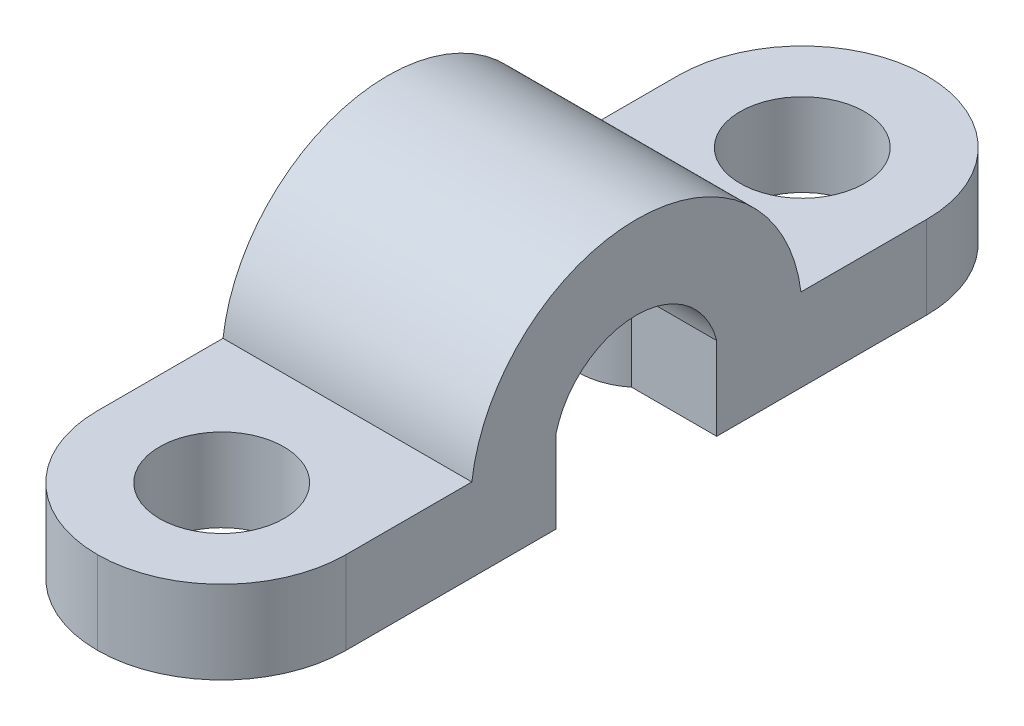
ISO-10303-21;
HEADER;
FILE_DESCRIPTION(('STEP AP214'),'2;1');
FILE_NAME('part.step','',(''),(''),'','','');
FILE_SCHEMA(('AUTOMOTIVE_DESIGN { 1 0 10303 214 1 1 1 1 }'));
ENDSEC;
DATA;
#1=APPLICATION_CONTEXT('core data for automotive mechanical design processes');
#2=APPLICATION_PROTOCOL_DEFINITION('international standard','automotive_design',2000,#1);
#3=PRODUCT_CONTEXT('',#1,'mechanical');
#4=PRODUCT('Part','Part','',(#3));
#5=PRODUCT_RELATED_PRODUCT_CATEGORY('part','',(#4));
#6=PRODUCT_DEFINITION_FORMATION('','',#4);
#7=PRODUCT_DEFINITION_CONTEXT('part definition',#1,'design');
#8=PRODUCT_DEFINITION('design','',#6,#7);
#9=PRODUCT_DEFINITION_SHAPE('','',#8);
#10=(LENGTH_UNIT() NAMED_UNIT(*) SI_UNIT(.MILLI.,.METRE.));
#11=(NAMED_UNIT(*) PLANE_ANGLE_UNIT() SI_UNIT($,.RADIAN.));
#12=(NAMED_UNIT(*) SI_UNIT($,.STERADIAN.) SOLID_ANGLE_UNIT());
#13=UNCERTAINTY_MEASURE_WITH_UNIT(LENGTH_MEASURE(1.E-05),#10,'distance_accuracy_value','');
#14=(GEOMETRIC_REPRESENTATION_CONTEXT(3) GLOBAL_UNCERTAINTY_ASSIGNED_CONTEXT((#13)) GLOBAL_UNIT_ASSIGNED_CONTEXT((#10,
#11,#12)) REPRESENTATION_CONTEXT('',''));
#15=CARTESIAN_POINT('',(0.,0.,0.));
#16=DIRECTION('',(0.,0.,1.));
#17=DIRECTION('',(1.,0.,0.));
#18=AXIS2_PLACEMENT_3D('',#15,#16,#17);
#19=CARTESIAN_POINT('',(3.,0.5,1.93649167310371));
#20=DIRECTION('',(0.,0.,1.));
#21=DIRECTION('',(1.,0.,0.));
#22=AXIS2_PLACEMENT_3D('',#19,#20,#21);
#23=PLANE('',#22);
#24=DIRECTION('',(-1.,0.,0.));
#25=VECTOR('',#24,1.);
#26=CARTESIAN_POINT('',(3.,-1.5,1.93649167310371));
#27=LINE('',#26,#25);
#28=CARTESIAN_POINT('',(3.,-1.5,1.93649167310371));
#29=VERTEX_POINT('',#28);
#30=CARTESIAN_POINT('',(0.946703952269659,-1.5,1.93649167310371));
#31=VERTEX_POINT('',#30);
#32=EDGE_CURVE('E178',#29,#31,#27,.T.);
#33=ORIENTED_EDGE('',*,*,#32,.T.);
#34=DIRECTION('',(0.,1.,0.));
#35=VECTOR('',#34,1.);
#36=CARTESIAN_POINT('',(0.946703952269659,-1.5,1.93649167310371));
#37=LINE('',#36,#35);
#38=CARTESIAN_POINT('',(0.946703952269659,0.,1.93649167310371));
#39=VERTEX_POINT('',#38);
#40=EDGE_CURVE('E158',#31,#39,#37,.T.);
#41=ORIENTED_EDGE('',*,*,#40,.T.);
#42=CARTESIAN_POINT('',(-0.960314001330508,0.208644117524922,1.93649167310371));
#43=CARTESIAN_POINT('',(-0.953571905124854,0.156180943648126,1.93649167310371));
#44=CARTESIAN_POINT('',(-0.949204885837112,0.103401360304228,1.93649167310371));
#45=CARTESIAN_POINT('',(-0.945821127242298,-0.00237025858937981,1.93649167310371));
#46=CARTESIAN_POINT('',(-0.9468076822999,-0.0553624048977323,1.93649167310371));
#47=CARTESIAN_POINT('',(-0.954035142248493,-0.161547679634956,1.93649167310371));
#48=CARTESIAN_POINT('',(-0.96033282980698,-0.214736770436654,1.93649167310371));
#49=CARTESIAN_POINT('',(-0.977413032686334,-0.320354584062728,1.93649167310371));
#50=CARTESIAN_POINT('',(-0.988195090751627,-0.372783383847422,1.93649167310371));
#51=CARTESIAN_POINT('',(-1.01940690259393,-0.503255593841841,1.93649167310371));
#52=CARTESIAN_POINT('',(-1.04195497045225,-0.58077586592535,1.93649167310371));
#53=CARTESIAN_POINT('',(-1.09088787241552,-0.73462084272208,1.93649167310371));
#54=CARTESIAN_POINT('',(-1.11727737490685,-0.810943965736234,1.93649167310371));
#55=CARTESIAN_POINT('',(-1.17115477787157,-0.963526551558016,1.93649167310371));
#56=CARTESIAN_POINT('',(-1.19864651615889,-1.03978463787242,1.93649167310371));
#57=CARTESIAN_POINT('',(-1.25251907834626,-1.19265249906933,1.93649167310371));
#58=CARTESIAN_POINT('',(-1.27890052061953,-1.26926205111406,1.93649167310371));
#59=CARTESIAN_POINT('',(-1.32870023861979,-1.42266986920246,1.93649167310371));
#60=CARTESIAN_POINT('',(-1.35214380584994,-1.49945974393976,1.93649167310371));
#61=CARTESIAN_POINT('',(-1.39500428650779,-1.65414920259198,1.93649167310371));
#62=CARTESIAN_POINT('',(-1.41442251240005,-1.73204841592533,1.93649167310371));
#63=CARTESIAN_POINT('',(-1.4479865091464,-1.88871952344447,1.93649167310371));
#64=CARTESIAN_POINT('',(-1.46215040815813,-1.96748743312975,1.93649167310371));
#65=CARTESIAN_POINT('',(-1.48420595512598,-2.12587638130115,1.93649167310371));
#66=CARTESIAN_POINT('',(-1.49209995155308,-2.20549708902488,1.93649167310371));
#67=CARTESIAN_POINT('',(-1.5026402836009,-2.40338689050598,1.93649167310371));
#68=CARTESIAN_POINT('',(-1.50097493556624,-2.52193888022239,1.93649167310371));
#69=CARTESIAN_POINT('',(-1.4787506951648,-2.75809656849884,1.93649167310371));
#70=CARTESIAN_POINT('',(-1.45808650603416,-2.87569330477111,1.93649167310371));
#71=CARTESIAN_POINT('',(-1.40116166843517,-3.08485429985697,1.93649167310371));
#72=CARTESIAN_POINT('',(-1.36831263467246,-3.17733962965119,1.93649167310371));
#73=CARTESIAN_POINT('',(-1.28783893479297,-3.35547566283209,1.93649167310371));
#74=CARTESIAN_POINT('',(-1.24025003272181,-3.44114228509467,1.93649167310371));
#75=CARTESIAN_POINT('',(-1.13009046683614,-3.60326123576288,1.93649167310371));
#76=CARTESIAN_POINT('',(-1.06741122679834,-3.67964045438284,1.93649167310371));
#77=CARTESIAN_POINT('',(-0.928459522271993,-3.81898975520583,1.93649167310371));
#78=CARTESIAN_POINT('',(-0.852185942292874,-3.88195873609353,1.93649167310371));
#79=CARTESIAN_POINT('',(-0.698416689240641,-3.98453471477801,1.93649167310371));
#80=CARTESIAN_POINT('',(-0.622190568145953,-4.02604862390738,1.93649167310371));
#81=CARTESIAN_POINT('',(-0.463413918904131,-4.09432034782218,1.93649167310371));
#82=CARTESIAN_POINT('',(-0.380868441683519,-4.12108981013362,1.93649167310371));
#83=CARTESIAN_POINT('',(-0.219336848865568,-4.15706217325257,1.93649167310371));
#84=CARTESIAN_POINT('',(-0.140635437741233,-4.16755336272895,1.93649167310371));
#85=CARTESIAN_POINT('',(0.017389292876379,-4.17471283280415,1.93649167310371));
#86=CARTESIAN_POINT('',(0.0967124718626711,-4.17138415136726,1.93649167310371));
#87=CARTESIAN_POINT('',(0.251149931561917,-4.1513605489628,1.93649167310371));
#88=CARTESIAN_POINT('',(0.326318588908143,-4.13508063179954,1.93649167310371));
#89=CARTESIAN_POINT('',(0.472908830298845,-4.09029649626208,1.93649167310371));
#90=CARTESIAN_POINT('',(0.544330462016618,-4.0617924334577,1.93649167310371));
#91=CARTESIAN_POINT('',(0.682549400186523,-3.99312631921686,1.93649167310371));
#92=CARTESIAN_POINT('',(0.749269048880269,-3.95280841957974,1.93649167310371));
#93=CARTESIAN_POINT('',(0.875443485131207,-3.86209269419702,1.93649167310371));
#94=CARTESIAN_POINT('',(0.934896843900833,-3.81169289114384,1.93649167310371));
#95=CARTESIAN_POINT('',(1.04847329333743,-3.69940677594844,1.93649167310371));
#96=CARTESIAN_POINT('',(1.10211946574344,-3.63703921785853,1.93649167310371));
#97=CARTESIAN_POINT('',(1.19926725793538,-3.50489034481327,1.93649167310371));
#98=CARTESIAN_POINT('',(1.24276721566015,-3.43510781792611,1.93649167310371));
#99=CARTESIAN_POINT('',(1.32311050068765,-3.28289416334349,1.93649167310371));
#100=CARTESIAN_POINT('',(1.35887331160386,-3.19989439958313,1.93649167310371));
#101=CARTESIAN_POINT('',(1.41802081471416,-3.02957765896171,1.93649167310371));
#102=CARTESIAN_POINT('',(1.44139182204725,-2.94225602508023,1.93649167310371));
#103=CARTESIAN_POINT('',(1.48424907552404,-2.72553497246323,1.93649167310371));
#104=CARTESIAN_POINT('',(1.49727720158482,-2.59485003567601,1.93649167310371));
#105=CARTESIAN_POINT('',(1.50195117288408,-2.33346574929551,1.93649167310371));
#106=CARTESIAN_POINT('',(1.49361221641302,-2.20276647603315,1.93649167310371));
#107=CARTESIAN_POINT('',(1.46376374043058,-1.97340486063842,1.93649167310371));
#108=CARTESIAN_POINT('',(1.44570193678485,-1.87425082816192,1.93649167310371));
#109=CARTESIAN_POINT('',(1.40161706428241,-1.67770892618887,1.93649167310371));
#110=CARTESIAN_POINT('',(1.37558904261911,-1.5803221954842,1.93649167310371));
#111=CARTESIAN_POINT('',(1.31772239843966,-1.38629666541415,1.93649167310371));
#112=CARTESIAN_POINT('',(1.28582870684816,-1.28967486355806,1.93649167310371));
#113=CARTESIAN_POINT('',(1.21935099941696,-1.09740675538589,1.93649167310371));
#114=CARTESIAN_POINT('',(1.18476731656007,-1.0017603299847,1.93649167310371));
#115=CARTESIAN_POINT('',(1.12823332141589,-0.842131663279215,1.93649167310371));
#116=CARTESIAN_POINT('',(1.10593207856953,-0.778276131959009,1.93649167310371));
#117=CARTESIAN_POINT('',(1.06347537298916,-0.64980411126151,1.93649167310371));
#118=CARTESIAN_POINT('',(1.04332080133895,-0.585187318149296,1.93649167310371));
#119=CARTESIAN_POINT('',(1.00751894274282,-0.455890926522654,1.93649167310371));
#120=CARTESIAN_POINT('',(0.99179865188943,-0.391232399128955,1.93649167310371));
#121=CARTESIAN_POINT('',(0.966674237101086,-0.260715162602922,1.93649167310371));
#122=CARTESIAN_POINT('',(0.957262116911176,-0.194858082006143,1.93649167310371));
#123=CARTESIAN_POINT('',(0.94643932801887,-0.060568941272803,1.93649167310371));
#124=CARTESIAN_POINT('',(0.945261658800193,0.00788337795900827,1.93649167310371));
#125=CARTESIAN_POINT('',(0.951817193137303,0.144375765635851,1.93649167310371));
#126=CARTESIAN_POINT('',(0.959556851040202,0.212415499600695,1.93649167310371));
#127=CARTESIAN_POINT('',(0.982417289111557,0.348266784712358,1.93649167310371));
#128=CARTESIAN_POINT('',(0.99765265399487,0.41605778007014,1.93649167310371));
#129=CARTESIAN_POINT('',(1.03300033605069,0.55033902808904,1.93649167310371));
#130=CARTESIAN_POINT('',(1.05311582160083,0.616828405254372,1.93649167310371));
#131=CARTESIAN_POINT('',(1.1038143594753,0.773379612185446,1.93649167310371));
#132=CARTESIAN_POINT('',(1.13551735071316,0.863065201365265,1.93649167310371));
#133=CARTESIAN_POINT('',(1.19934456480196,1.04225104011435,1.93649167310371));
#134=CARTESIAN_POINT('',(1.23146871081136,1.13175132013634,1.93649167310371));
#135=CARTESIAN_POINT('',(1.29287633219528,1.31101859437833,1.93649167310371));
#136=CARTESIAN_POINT('',(1.32217905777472,1.40077872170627,1.93649167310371));
#137=CARTESIAN_POINT('',(1.3758650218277,1.58174910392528,1.93649167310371));
#138=CARTESIAN_POINT('',(1.40024976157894,1.67295890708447,1.93649167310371));
#139=CARTESIAN_POINT('',(1.45321438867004,1.90587756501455,1.93649167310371));
#140=CARTESIAN_POINT('',(1.47716279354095,2.04871891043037,1.93649167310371));
#141=CARTESIAN_POINT('',(1.5024651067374,2.33693081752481,1.93649167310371));
#142=CARTESIAN_POINT('',(1.50378987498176,2.48230439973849,1.93649167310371));
#143=CARTESIAN_POINT('',(1.48171782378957,2.73301171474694,1.93649167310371));
#144=CARTESIAN_POINT('',(1.46468469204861,2.83889047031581,1.93649167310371));
#145=CARTESIAN_POINT('',(1.41372726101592,3.04651722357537,1.93649167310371));
#146=CARTESIAN_POINT('',(1.37982031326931,3.14826934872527,1.93649167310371));
#147=CARTESIAN_POINT('',(1.29388936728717,3.34502888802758,1.93649167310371));
#148=CARTESIAN_POINT('',(1.241704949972,3.43996730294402,1.93649167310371));
#149=CARTESIAN_POINT('',(1.11955276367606,3.6177261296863,1.93649167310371));
#150=CARTESIAN_POINT('',(1.0495951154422,3.70055339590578,1.93649167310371));
#151=CARTESIAN_POINT('',(0.904873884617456,3.83887041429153,1.93649167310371));
#152=CARTESIAN_POINT('',(0.832224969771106,3.89657523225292,1.93649167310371));
#153=CARTESIAN_POINT('',(0.677254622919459,3.99705917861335,1.93649167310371));
#154=CARTESIAN_POINT('',(0.594942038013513,4.03985181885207,1.93649167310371));
#155=CARTESIAN_POINT('',(0.43338588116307,4.1044225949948,1.93649167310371));
#156=CARTESIAN_POINT('',(0.354877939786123,4.12805145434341,1.93649167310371));
#157=CARTESIAN_POINT('',(0.19491498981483,4.16095913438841,1.93649167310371));
#158=CARTESIAN_POINT('',(0.113461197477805,4.17024380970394,1.93649167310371));
#159=CARTESIAN_POINT('',(-0.04538954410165,4.17396650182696,1.93649167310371));
#160=CARTESIAN_POINT('',(-0.12276959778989,4.16917459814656,1.93649167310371));
#161=CARTESIAN_POINT('',(-0.275598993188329,4.14658567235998,1.93649167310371));
#162=CARTESIAN_POINT('',(-0.351048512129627,4.1287898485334,1.93649167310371));
#163=CARTESIAN_POINT('',(-0.497527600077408,4.0810049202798,1.93649167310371));
#164=CARTESIAN_POINT('',(-0.568578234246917,4.05108011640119,1.93649167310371));
#165=CARTESIAN_POINT('',(-0.704886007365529,3.98013498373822,1.93649167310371));
#166=CARTESIAN_POINT('',(-0.770142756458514,3.93911390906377,1.93649167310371));
#167=CARTESIAN_POINT('',(-0.895691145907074,3.84567608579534,1.93649167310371));
#168=CARTESIAN_POINT('',(-0.955710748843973,3.79289471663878,1.93649167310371));
#169=CARTESIAN_POINT('',(-1.06681914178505,3.67866352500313,1.93649167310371));
#170=CARTESIAN_POINT('',(-1.11790494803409,3.61721081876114,1.93649167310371));
#171=CARTESIAN_POINT('',(-1.21411270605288,3.48234408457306,1.93649167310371));
#172=CARTESIAN_POINT('',(-1.25844571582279,3.40836880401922,1.93649167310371));
#173=CARTESIAN_POINT('',(-1.33562890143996,3.25469785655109,1.93649167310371));
#174=CARTESIAN_POINT('',(-1.36847671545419,3.17500101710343,1.93649167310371));
#175=CARTESIAN_POINT('',(-1.42638034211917,3.0015052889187,1.93649167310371));
#176=CARTESIAN_POINT('',(-1.44991437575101,2.9072017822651,1.93649167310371));
#177=CARTESIAN_POINT('',(-1.48359170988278,2.71625821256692,1.93649167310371));
#178=CARTESIAN_POINT('',(-1.49372805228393,2.61961696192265,1.93649167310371));
#179=CARTESIAN_POINT('',(-1.5011945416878,2.44412831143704,1.93649167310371));
#180=CARTESIAN_POINT('',(-1.50057442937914,2.3653522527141,1.93649167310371));
#181=CARTESIAN_POINT('',(-1.49227964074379,2.20813197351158,1.93649167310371));
#182=CARTESIAN_POINT('',(-1.48459975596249,2.1296880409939,1.93649167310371));
#183=CARTESIAN_POINT('',(-1.46308483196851,1.97327078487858,1.93649167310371));
#184=CARTESIAN_POINT('',(-1.44921876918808,1.89530186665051,1.93649167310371));
#185=CARTESIAN_POINT('',(-1.41640219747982,1.74053414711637,1.93649167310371));
#186=CARTESIAN_POINT('',(-1.3974560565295,1.66373440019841,1.93649167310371));
#187=CARTESIAN_POINT('',(-1.3444157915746,1.47056528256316,1.93649167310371));
#188=CARTESIAN_POINT('',(-1.30763322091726,1.35494869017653,1.93649167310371));
#189=CARTESIAN_POINT('',(-1.24899474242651,1.18257975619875,1.93649167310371));
#190=CARTESIAN_POINT('',(-1.2288371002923,1.12521108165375,1.93649167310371));
#191=CARTESIAN_POINT('',(-1.18814156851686,1.01060763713,1.93649167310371));
#192=CARTESIAN_POINT('',(-1.16760369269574,0.953372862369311,1.93649167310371));
#193=CARTESIAN_POINT('',(-1.12745135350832,0.839838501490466,1.93649167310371));
#194=CARTESIAN_POINT('',(-1.10782668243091,0.783542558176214,1.93649167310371));
#195=CARTESIAN_POINT('',(-1.07015615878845,0.670391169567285,1.93649167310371));
#196=CARTESIAN_POINT('',(-1.05211083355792,0.613535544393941,1.93649167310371));
#197=CARTESIAN_POINT('',(-1.0190394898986,0.499223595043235,1.93649167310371));
#198=CARTESIAN_POINT('',(-1.00399937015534,0.441771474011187,1.93649167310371));
#199=CARTESIAN_POINT('',(-0.978418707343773,0.325892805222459,1.93649167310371));
#200=CARTESIAN_POINT('',(-0.967873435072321,0.267467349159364,1.93649167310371));
#201=CARTESIAN_POINT('',(-0.960314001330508,0.208644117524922,1.93649167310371));
#202=B_SPLINE_CURVE_WITH_KNOTS('',3,(#42,#43,#44,#45,#46,#47,#48,#49,#50,#51,#52,#53,#54,#55,
#56,#57,#58,#59,#60,#61,#62,#63,#64,#65,#66,#67,#68,#69,#70,#71,#72,#73,#74,#75,#76,#77,#78,#79,
#80,#81,#82,#83,#84,#85,#86,#87,#88,#89,#90,#91,#92,#93,#94,#95,#96,#97,#98,#99,#100,#101,#102,
#103,#104,#105,#106,#107,#108,#109,#110,#111,#112,#113,#114,#115,#116,#117,#118,#119,#120,#121,
#122,#123,#124,#125,#126,#127,#128,#129,#130,#131,#132,#133,#134,#135,#136,#137,#138,#139,#140,
#141,#142,#143,#144,#145,#146,#147,#148,#149,#150,#151,#152,#153,#154,#155,#156,#157,#158,#159,
#160,#161,#162,#163,#164,#165,#166,#167,#168,#169,#170,#171,#172,#173,#174,#175,#176,#177,#178,
#179,#180,#181,#182,#183,#184,#185,#186,#187,#188,#189,#190,#191,#192,#193,#194,#195,#196,#197,
#198,#199,#200,#201),.UNSPECIFIED.,.T.,.F.,(4,2,2,2,2,2,2,2,2,2,2,2,2,2,2,2,2,2,2,2,2,2,2,2,2,2,
2,2,2,2,2,2,2,2,2,2,2,2,2,2,2,2,2,2,2,2,2,2,2,2,2,2,2,2,2,2,2,2,2,2,2,2,2,2,2,2,2,2,2,2,2,2,2,2,
2,2,2,2,2,4),(0.,0.158629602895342,0.317356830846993,0.477802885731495,0.63823258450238,
0.880191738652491,1.12244743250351,1.36563584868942,1.60868697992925,1.84947618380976,
2.09018675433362,2.33005894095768,2.56984123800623,2.92423291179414,3.28060063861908,
3.57383446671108,3.86636230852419,4.16106135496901,4.45578459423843,4.71477215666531,
4.97355483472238,5.21056841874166,5.44752990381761,5.67719007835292,5.90684733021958,
6.13968222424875,6.37256282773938,6.61832839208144,6.86413418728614,7.13419688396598,
7.40455720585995,7.79633370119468,8.1878316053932,8.48980661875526,8.79196976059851,
9.0971297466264,9.40225201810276,9.60515558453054,9.80814305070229,10.0075622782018,
10.2067282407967,10.4115077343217,10.6164355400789,10.8245981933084,11.0328963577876,
11.3182294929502,11.6035112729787,11.8866833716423,12.1697688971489,12.6029582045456,
13.0367054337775,13.357215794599,13.67739724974,14.0004623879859,14.3233439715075,
14.6000944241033,14.876593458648,15.121295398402,15.365897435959,15.5973716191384,
15.8288244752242,16.0590660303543,16.2893230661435,16.5280758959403,16.7669083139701,
17.0245909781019,17.2823266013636,17.5728328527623,17.8634899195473,18.0994894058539,
18.3356631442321,18.5730348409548,18.8102030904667,19.1739244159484,19.3563531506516,
19.5387752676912,19.7176239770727,19.8965321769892,20.0745800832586,20.2524401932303),.UNSPECIFIED.);
#203=CARTESIAN_POINT('',(1.01980390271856,0.5,1.93649167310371));
#204=VERTEX_POINT('',#203);
#205=EDGE_CURVE('E379',#39,#204,#202,.T.);
#206=ORIENTED_EDGE('',*,*,#205,.T.);
#207=DIRECTION('',(-1.,0.,0.));
#208=VECTOR('',#207,1.);
#209=CARTESIAN_POINT('',(3.,0.5,1.93649167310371));
#210=LINE('',#209,#208);
#211=CARTESIAN_POINT('',(3.,0.5,1.93649167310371));
#212=VERTEX_POINT('',#211);
#213=EDGE_CURVE('E200',#212,#204,#210,.T.);
#214=ORIENTED_EDGE('',*,*,#213,.F.);
#215=DIRECTION('',(0.,1.,0.));
#216=VECTOR('',#215,1.);
#217=CARTESIAN_POINT('',(3.,0.5,1.93649167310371));
#218=LINE('',#217,#216);
#219=EDGE_CURVE('E244',#29,#212,#218,.T.);
#220=ORIENTED_EDGE('',*,*,#219,.F.);
#221=EDGE_LOOP('',(#33,#41,#206,#214,#220));
#222=FACE_BOUND('',#221,.T.);
#223=ADVANCED_FACE('F28',(#222),#23,.F.);
#224=CARTESIAN_POINT('',(3.,0.5,-1.93649167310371));
#225=DIRECTION('',(0.,0.,-1.));
#226=DIRECTION('',(-1.,0.,0.));
#227=AXIS2_PLACEMENT_3D('',#224,#225,#226);
#228=PLANE('',#227);
#229=DIRECTION('',(-1.,0.,0.));
#230=VECTOR('',#229,1.);
#231=CARTESIAN_POINT('',(3.,-1.5,-1.93649167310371));
#232=LINE('',#231,#230);
#233=CARTESIAN_POINT('',(-0.946703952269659,-1.5,-1.93649167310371));
#234=VERTEX_POINT('',#233);
#235=CARTESIAN_POINT('',(-3.,-1.5,-1.93649167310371));
#236=VERTEX_POINT('',#235);
#237=EDGE_CURVE('E191',#234,#236,#232,.T.);
#238=ORIENTED_EDGE('',*,*,#237,.F.);
#239=DIRECTION('',(0.,1.,0.));
#240=VECTOR('',#239,1.);
#241=CARTESIAN_POINT('',(-0.946703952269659,-1.5,-1.93649167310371));
#242=LINE('',#241,#240);
#243=CARTESIAN_POINT('',(-0.946703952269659,0.,-1.93649167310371));
#244=VERTEX_POINT('',#243);
#245=EDGE_CURVE('E348',#234,#244,#242,.T.);
#246=ORIENTED_EDGE('',*,*,#245,.T.);
#247=CARTESIAN_POINT('',(-0.960314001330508,0.208644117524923,-1.93649167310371));
#248=CARTESIAN_POINT('',(-0.971479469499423,0.295524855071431,-1.93649167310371));
#249=CARTESIAN_POINT('',(-0.989196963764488,0.381517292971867,-1.93649167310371));
#250=CARTESIAN_POINT('',(-1.03277268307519,0.551483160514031,-1.93649167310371));
#251=CARTESIAN_POINT('',(-1.05865495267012,0.635449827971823,-1.93649167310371));
#252=CARTESIAN_POINT('',(-1.11427557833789,0.803275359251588,-1.93649167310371));
#253=CARTESIAN_POINT('',(-1.14406032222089,0.887118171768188,-1.93649167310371));
#254=CARTESIAN_POINT('',(-1.20378402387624,1.05463163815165,-1.93649167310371));
#255=CARTESIAN_POINT('',(-1.23372276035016,1.1383023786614,-1.93649167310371));
#256=CARTESIAN_POINT('',(-1.29939091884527,1.33007425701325,-1.93649167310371));
#257=CARTESIAN_POINT('',(-1.3343856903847,1.43843803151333,-1.93649167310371));
#258=CARTESIAN_POINT('',(-1.39659425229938,1.65753026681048,-1.93649167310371));
#259=CARTESIAN_POINT('',(-1.42380390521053,1.76825995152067,-1.93649167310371));
#260=CARTESIAN_POINT('',(-1.46678878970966,1.99071025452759,-1.93649167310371));
#261=CARTESIAN_POINT('',(-1.48269019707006,2.1024053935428,-1.93649167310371));
#262=CARTESIAN_POINT('',(-1.50059150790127,2.32683968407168,-1.93649167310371));
#263=CARTESIAN_POINT('',(-1.50261398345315,2.43957684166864,-1.93649167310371));
#264=CARTESIAN_POINT('',(-1.49073511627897,2.65524693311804,-1.93649167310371));
#265=CARTESIAN_POINT('',(-1.47809435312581,2.75824288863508,-1.93649167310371));
#266=CARTESIAN_POINT('',(-1.43727518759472,2.96138847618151,-1.93649167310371));
#267=CARTESIAN_POINT('',(-1.40907095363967,3.06153308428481,-1.93649167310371));
#268=CARTESIAN_POINT('',(-1.33585177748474,3.25638247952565,-1.93649167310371));
#269=CARTESIAN_POINT('',(-1.29072094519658,3.35104444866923,-1.93649167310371));
#270=CARTESIAN_POINT('',(-1.18359264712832,3.53031659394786,-1.93649167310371));
#271=CARTESIAN_POINT('',(-1.12161073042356,3.61493593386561,-1.93649167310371));
#272=CARTESIAN_POINT('',(-0.988265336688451,3.76302152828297,-1.93649167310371));
#273=CARTESIAN_POINT('',(-0.918263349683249,3.82771044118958,-1.93649167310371));
#274=CARTESIAN_POINT('',(-0.767090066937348,3.94239477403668,-1.93649167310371));
#275=CARTESIAN_POINT('',(-0.685926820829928,3.99240070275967,-1.93649167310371));
#276=CARTESIAN_POINT('',(-0.525786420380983,4.07002944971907,-1.93649167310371));
#277=CARTESIAN_POINT('',(-0.447774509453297,4.09965236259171,-1.93649167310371));
#278=CARTESIAN_POINT('',(-0.287698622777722,4.14436697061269,-1.93649167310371));
#279=CARTESIAN_POINT('',(-0.205636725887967,4.15946604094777,-1.93649167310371));
#280=CARTESIAN_POINT('',(-0.0454642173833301,4.17399045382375,-1.93649167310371));
#281=CARTESIAN_POINT('',(0.0325623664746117,4.17435871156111,-1.93649167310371));
#282=CARTESIAN_POINT('',(0.187527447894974,4.16178650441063,-1.93649167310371));
#283=CARTESIAN_POINT('',(0.264466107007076,4.1488480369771,-1.93649167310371));
#284=CARTESIAN_POINT('',(0.413998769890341,4.11044288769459,-1.93649167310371));
#285=CARTESIAN_POINT('',(0.486638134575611,4.08515188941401,-1.93649167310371));
#286=CARTESIAN_POINT('',(0.626806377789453,4.02306501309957,-1.93649167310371));
#287=CARTESIAN_POINT('',(0.694334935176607,3.98626841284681,-1.93649167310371));
#288=CARTESIAN_POINT('',(0.824558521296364,3.90123576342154,-1.93649167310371));
#289=CARTESIAN_POINT('',(0.88705672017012,3.85269905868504,-1.93649167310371));
#290=CARTESIAN_POINT('',(1.00367431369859,3.7464534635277,-1.93649167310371));
#291=CARTESIAN_POINT('',(1.05779162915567,3.68874230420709,-1.93649167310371));
#292=CARTESIAN_POINT('',(1.16030664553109,3.56157131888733,-1.93649167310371));
#293=CARTESIAN_POINT('',(1.20803033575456,3.49156956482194,-1.93649167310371));
#294=CARTESIAN_POINT('',(1.29243823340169,3.34524026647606,-1.93649167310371));
#295=CARTESIAN_POINT('',(1.32912001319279,3.26891133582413,-1.93649167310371));
#296=CARTESIAN_POINT('',(1.39512233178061,3.10275572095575,-1.93649167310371));
#297=CARTESIAN_POINT('',(1.42308585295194,3.01239292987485,-1.93649167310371));
#298=CARTESIAN_POINT('',(1.46595606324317,2.82858569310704,-1.93649167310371));
#299=CARTESIAN_POINT('',(1.48084870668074,2.73513804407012,-1.93649167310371));
#300=CARTESIAN_POINT('',(1.49667288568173,2.56816108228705,-1.93649167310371));
#301=CARTESIAN_POINT('',(1.49997726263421,2.49483736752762,-1.93649167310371));
#302=CARTESIAN_POINT('',(1.50002250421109,2.34816422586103,-1.93649167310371));
#303=CARTESIAN_POINT('',(1.49676024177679,2.27481480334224,-1.93649167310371));
#304=CARTESIAN_POINT('',(1.48440850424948,2.12871677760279,-1.93649167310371));
#305=CARTESIAN_POINT('',(1.47532584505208,2.05596757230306,-1.93649167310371));
#306=CARTESIAN_POINT('',(1.45213436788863,1.91126990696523,-1.93649167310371));
#307=CARTESIAN_POINT('',(1.43802402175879,1.83932169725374,-1.93649167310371));
#308=CARTESIAN_POINT('',(1.40496927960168,1.69346714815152,-1.93649167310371));
#309=CARTESIAN_POINT('',(1.38585092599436,1.61960091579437,-1.93649167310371));
#310=CARTESIAN_POINT('',(1.34413558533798,1.47287053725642,-1.93649167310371));
#311=CARTESIAN_POINT('',(1.32153835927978,1.40000646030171,-1.93649167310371));
#312=CARTESIAN_POINT('',(1.2738279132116,1.25442234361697,-1.93649167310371));
#313=CARTESIAN_POINT('',(1.2486946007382,1.18170901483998,-1.93649167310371));
#314=CARTESIAN_POINT('',(1.19749327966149,1.03661226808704,-1.93649167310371));
#315=CARTESIAN_POINT('',(1.17142518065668,0.964228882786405,-1.93649167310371));
#316=CARTESIAN_POINT('',(1.11976796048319,0.818058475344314,-1.93649167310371));
#317=CARTESIAN_POINT('',(1.09419191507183,0.744266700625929,-1.93649167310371));
#318=CARTESIAN_POINT('',(1.04643966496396,0.595503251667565,-1.93649167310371));
#319=CARTESIAN_POINT('',(1.02426509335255,0.520531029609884,-1.93649167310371));
#320=CARTESIAN_POINT('',(0.987083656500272,0.370395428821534,-1.93649167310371));
#321=CARTESIAN_POINT('',(0.971935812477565,0.295269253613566,-1.93649167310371));
#322=CARTESIAN_POINT('',(0.951555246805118,0.143761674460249,-1.93649167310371));
#323=CARTESIAN_POINT('',(0.946297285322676,0.0673839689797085,-1.93649167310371));
#324=CARTESIAN_POINT('',(0.94715811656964,-0.0846940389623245,-1.93649167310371));
#325=CARTESIAN_POINT('',(0.953186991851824,-0.160394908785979,-1.93649167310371));
#326=CARTESIAN_POINT('',(0.974746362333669,-0.310510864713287,-1.93649167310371));
#327=CARTESIAN_POINT('',(0.990301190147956,-0.384922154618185,-1.93649167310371));
#328=CARTESIAN_POINT('',(1.02804574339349,-0.533888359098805,-1.93649167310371));
#329=CARTESIAN_POINT('',(1.05038903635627,-0.608401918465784,-1.93649167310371));
#330=CARTESIAN_POINT('',(1.09828212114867,-0.756303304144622,-1.93649167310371));
#331=CARTESIAN_POINT('',(1.12383027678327,-0.829691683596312,-1.93649167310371));
#332=CARTESIAN_POINT('',(1.16870782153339,-0.956420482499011,-1.93649167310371));
#333=CARTESIAN_POINT('',(1.18785501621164,-1.00982693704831,-1.93649167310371));
#334=CARTESIAN_POINT('',(1.22584088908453,-1.1167487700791,-1.93649167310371));
#335=CARTESIAN_POINT('',(1.24467956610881,-1.17026414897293,-1.93649167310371));
#336=CARTESIAN_POINT('',(1.29979479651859,-1.33132580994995,-1.93649167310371));
#337=CARTESIAN_POINT('',(1.33466578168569,-1.43937513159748,-1.93649167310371));
#338=CARTESIAN_POINT('',(1.39616654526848,-1.65607299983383,-1.93649167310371));
#339=CARTESIAN_POINT('',(1.42291557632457,-1.76468635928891,-1.93649167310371));
#340=CARTESIAN_POINT('',(1.46567535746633,-1.98397781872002,-1.93649167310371));
#341=CARTESIAN_POINT('',(1.48169768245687,-2.09465356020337,-1.93649167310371));
#342=CARTESIAN_POINT('',(1.50027155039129,-2.31844529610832,-1.93649167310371));
#343=CARTESIAN_POINT('',(1.5026753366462,-2.43157473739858,-1.93649167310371));
#344=CARTESIAN_POINT('',(1.49096362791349,-2.65756366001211,-1.93649167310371));
#345=CARTESIAN_POINT('',(1.47678074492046,-2.77042016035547,-1.93649167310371));
#346=CARTESIAN_POINT('',(1.4294919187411,-2.99321977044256,-1.93649167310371));
#347=CARTESIAN_POINT('',(1.39622831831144,-3.1031305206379,-1.93649167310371));
#348=CARTESIAN_POINT('',(1.30949811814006,-3.31455685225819,-1.93649167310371));
#349=CARTESIAN_POINT('',(1.25608416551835,-3.41609347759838,-1.93649167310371));
#350=CARTESIAN_POINT('',(1.14492871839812,-3.58257596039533,-1.93649167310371));
#351=CARTESIAN_POINT('',(1.09145963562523,-3.65038923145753,-1.93649167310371));
#352=CARTESIAN_POINT('',(0.973936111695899,-3.77619541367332,-1.93649167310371));
#353=CARTESIAN_POINT('',(0.909883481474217,-3.83419000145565,-1.93649167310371));
#354=CARTESIAN_POINT('',(0.772326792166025,-3.93829678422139,-1.93649167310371));
#355=CARTESIAN_POINT('',(0.698787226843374,-3.98436227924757,-1.93649167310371));
#356=CARTESIAN_POINT('',(0.544527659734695,-4.0623170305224,-1.93649167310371));
#357=CARTESIAN_POINT('',(0.463809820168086,-4.09421053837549,-1.93649167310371));
#358=CARTESIAN_POINT('',(0.304073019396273,-4.14054778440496,-1.93649167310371));
#359=CARTESIAN_POINT('',(0.225380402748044,-4.15612051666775,-1.93649167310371));
#360=CARTESIAN_POINT('',(0.0664920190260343,-4.17324522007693,-1.93649167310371));
#361=CARTESIAN_POINT('',(-0.0137032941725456,-4.17480135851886,-1.93649167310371));
#362=CARTESIAN_POINT('',(-0.17002736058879,-4.16404997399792,-1.93649167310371));
#363=CARTESIAN_POINT('',(-0.246193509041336,-4.15227582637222,-1.93649167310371));
#364=CARTESIAN_POINT('',(-0.395480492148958,-4.11617940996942,-1.93649167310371));
#365=CARTESIAN_POINT('',(-0.468601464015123,-4.0918577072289,-1.93649167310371));
#366=CARTESIAN_POINT('',(-0.610307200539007,-4.0313806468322,-1.93649167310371));
#367=CARTESIAN_POINT('',(-0.678860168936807,-3.99515103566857,-1.93649167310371));
#368=CARTESIAN_POINT('',(-0.809271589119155,-3.91219544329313,-1.93649167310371));
#369=CARTESIAN_POINT('',(-0.871129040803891,-3.86546789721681,-1.93649167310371));
#370=CARTESIAN_POINT('',(-0.989671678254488,-3.76059305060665,-1.93649167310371));
#371=CARTESIAN_POINT('',(-1.04596642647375,-3.70200548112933,-1.93649167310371));
#372=CARTESIAN_POINT('',(-1.14887991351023,-3.57690535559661,-1.93649167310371));
#373=CARTESIAN_POINT('',(-1.19549646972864,-3.51039101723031,-1.93649167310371));
#374=CARTESIAN_POINT('',(-1.28236934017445,-3.36502610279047,-1.93649167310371));
#375=CARTESIAN_POINT('',(-1.32166647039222,-3.2856038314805,-1.93649167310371));
#376=CARTESIAN_POINT('',(-1.38822720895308,-3.12187562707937,-1.93649167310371));
#377=CARTESIAN_POINT('',(-1.41548142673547,-3.03756594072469,-1.93649167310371));
#378=CARTESIAN_POINT('',(-1.4672070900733,-2.83093704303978,-1.93649167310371));
#379=CARTESIAN_POINT('',(-1.48597541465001,-2.70718257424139,-1.93649167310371));
#380=CARTESIAN_POINT('',(-1.50305607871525,-2.45845739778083,-1.93649167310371));
#381=CARTESIAN_POINT('',(-1.50136173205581,-2.33348630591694,-1.93649167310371));
#382=CARTESIAN_POINT('',(-1.48381867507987,-2.11886382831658,-1.93649167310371));
#383=CARTESIAN_POINT('',(-1.47193988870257,-2.02883962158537,-1.93649167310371));
#384=CARTESIAN_POINT('',(-1.44072809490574,-1.85006540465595,-1.93649167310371));
#385=CARTESIAN_POINT('',(-1.42139082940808,-1.76131615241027,-1.93649167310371));
#386=CARTESIAN_POINT('',(-1.37678204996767,-1.58476623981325,-1.93649167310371));
#387=CARTESIAN_POINT('',(-1.35147367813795,-1.49697516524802,-1.93649167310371));
#388=CARTESIAN_POINT('',(-1.29686479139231,-1.32263567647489,-1.93649167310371));
#389=CARTESIAN_POINT('',(-1.26756260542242,-1.23608779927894,-1.93649167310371));
#390=CARTESIAN_POINT('',(-1.20919175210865,-1.06923933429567,-1.93649167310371));
#391=CARTESIAN_POINT('',(-1.18023236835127,-0.988899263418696,-1.93649167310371));
#392=CARTESIAN_POINT('',(-1.12314161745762,-0.82780894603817,-1.93649167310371));
#393=CARTESIAN_POINT('',(-1.09501124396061,-0.747058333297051,-1.93649167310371));
#394=CARTESIAN_POINT('',(-1.04317841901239,-0.585093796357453,-1.93649167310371));
#395=CARTESIAN_POINT('',(-1.01942939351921,-0.503895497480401,-1.93649167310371));
#396=CARTESIAN_POINT('',(-0.98038087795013,-0.339557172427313,-1.93649167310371));
#397=CARTESIAN_POINT('',(-0.965056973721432,-0.2564234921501,-1.93649167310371));
#398=CARTESIAN_POINT('',(-0.949263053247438,-0.109251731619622,-1.93649167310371));
#399=CARTESIAN_POINT('',(-0.946075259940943,-0.0455205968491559,-1.93649167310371));
#400=CARTESIAN_POINT('',(-0.947541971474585,0.0818449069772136,-1.93649167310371));
#401=CARTESIAN_POINT('',(-0.952196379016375,0.145479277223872,-1.93649167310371));
#402=CARTESIAN_POINT('',(-0.960314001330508,0.208644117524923,-1.93649167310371));
#403=B_SPLINE_CURVE_WITH_KNOTS('',3,(#247,#248,#249,#250,#251,#252,#253,#254,#255,#256,#257,
#258,#259,#260,#261,#262,#263,#264,#265,#266,#267,#268,#269,#270,#271,#272,#273,#274,#275,#276,
#277,#278,#279,#280,#281,#282,#283,#284,#285,#286,#287,#288,#289,#290,#291,#292,#293,#294,#295,
#296,#297,#298,#299,#300,#301,#302,#303,#304,#305,#306,#307,#308,#309,#310,#311,#312,#313,#314,
#315,#316,#317,#318,#319,#320,#321,#322,#323,#324,#325,#326,#327,#328,#329,#330,#331,#332,#333,
#334,#335,#336,#337,#338,#339,#340,#341,#342,#343,#344,#345,#346,#347,#348,#349,#350,#351,#352,
#353,#354,#355,#356,#357,#358,#359,#360,#361,#362,#363,#364,#365,#366,#367,#368,#369,#370,#371,
#372,#373,#374,#375,#376,#377,#378,#379,#380,#381,#382,#383,#384,#385,#386,#387,#388,#389,#390,
#391,#392,#393,#394,#395,#396,#397,#398,#399,#400,#401,#402),.UNSPECIFIED.,.T.,.F.,(4,2,2,2,2,2,
2,2,2,2,2,2,2,2,2,2,2,2,2,2,2,2,2,2,2,2,2,2,2,2,2,2,2,2,2,2,2,2,2,2,2,2,2,2,2,2,2,2,2,2,2,2,2,2,
2,2,2,2,2,2,2,2,2,2,2,2,2,2,2,2,2,2,2,2,2,2,2,4),(0.,0.262657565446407,0.52609597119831,
0.793011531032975,1.05961468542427,1.40108112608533,1.74272870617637,2.08050173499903,
2.41772529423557,2.72797922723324,3.0387496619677,3.35168786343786,3.66433828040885,
3.94862086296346,4.23269948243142,4.48173730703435,4.73064860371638,4.96359982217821,
5.19651607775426,5.42621212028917,5.65592258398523,5.8922911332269,6.1287182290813,
6.38184531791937,6.63502801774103,6.917731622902,7.20073864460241,7.42063082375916,
7.64062774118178,7.86036750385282,8.08017411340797,8.30896178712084,8.5377651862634,
8.76854987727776,8.99935694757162,9.23363083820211,9.46801685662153,9.6974719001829,
9.92634055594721,10.1533936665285,10.3810291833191,10.6142553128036,10.847362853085,
11.0175682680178,11.1877743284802,11.5282265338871,11.863406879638,12.1982249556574,
12.5366688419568,12.8764925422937,13.2191653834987,13.5609490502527,13.8189286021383,
14.0768640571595,14.3357945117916,14.5946472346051,14.8340929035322,15.0734673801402,
15.3035923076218,15.5337068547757,15.7652844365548,15.9968965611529,16.2396187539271,
16.4823956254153,16.7471730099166,17.0121564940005,17.3855800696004,17.7591256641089,
18.03120109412,18.3034320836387,18.5773895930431,18.851462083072,19.1076693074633,
19.3641720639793,19.6177675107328,19.8706241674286,20.0615862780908,20.2525460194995),.UNSPECIFIED.);
#404=CARTESIAN_POINT('',(-1.01980390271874,0.50000000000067,-1.93649167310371));
#405=VERTEX_POINT('',#404);
#406=EDGE_CURVE('E203',#244,#405,#403,.T.);
#407=ORIENTED_EDGE('',*,*,#406,.T.);
#408=DIRECTION('',(-1.,0.,0.));
#409=VECTOR('',#408,1.);
#410=CARTESIAN_POINT('',(3.,0.5,-1.93649167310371));
#411=LINE('',#410,#409);
#412=CARTESIAN_POINT('',(-3.,0.5,-1.93649167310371));
#413=VERTEX_POINT('',#412);
#414=EDGE_CURVE('E195',#405,#413,#411,.T.);
#415=ORIENTED_EDGE('',*,*,#414,.T.);
#416=DIRECTION('',(0.,-1.,0.));
#417=VECTOR('',#416,1.);
#418=CARTESIAN_POINT('',(-3.,0.5,-1.93649167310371));
#419=LINE('',#418,#417);
#420=EDGE_CURVE('E356',#413,#236,#419,.T.);
#421=ORIENTED_EDGE('',*,*,#420,.T.);
#422=EDGE_LOOP('',(#238,#246,#407,#415,#421));
#423=FACE_BOUND('',#422,.T.);
#424=ADVANCED_FACE('F220',(#423),#228,.F.);
#425=CARTESIAN_POINT('',(3.,0.,0.));
#426=DIRECTION('',(-1.,0.,0.));
#427=DIRECTION('',(0.,0.,1.));
#428=AXIS2_PLACEMENT_3D('',#425,#426,#427);
#429=CYLINDRICAL_SURFACE('',#428,2.);
#430=ORIENTED_EDGE('',*,*,#414,.F.);
#431=CARTESIAN_POINT('',(-1.01980390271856,0.,0.));
#432=DIRECTION('',(1.,0.,0.));
#433=DIRECTION('',(0.,0.,-1.));
#434=AXIS2_PLACEMENT_3D('',#431,#432,#433);
#435=CIRCLE('',#434,2.);
#436=CARTESIAN_POINT('',(-1.01980390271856,0.5,1.93649167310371));
#437=VERTEX_POINT('',#436);
#438=EDGE_CURVE('E264',#405,#437,#435,.T.);
#439=ORIENTED_EDGE('',*,*,#438,.T.);
#440=CARTESIAN_POINT('',(-3.,0.5,1.93649167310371));
#441=VERTEX_POINT('',#440);
#442=EDGE_CURVE('E199',#437,#441,#210,.T.);
#443=ORIENTED_EDGE('',*,*,#442,.T.);
#444=CARTESIAN_POINT('',(-3.,0.,0.));
#445=DIRECTION('',(-1.,0.,0.));
#446=DIRECTION('',(0.,0.,-1.));
#447=AXIS2_PLACEMENT_3D('',#444,#445,#446);
#448=CIRCLE('',#447,2.);
#449=EDGE_CURVE('E353',#441,#413,#448,.T.);
#450=ORIENTED_EDGE('',*,*,#449,.T.);
#451=EDGE_LOOP('',(#430,#439,#443,#450));
#452=FACE_BOUND('',#451,.T.);
#453=ADVANCED_FACE('F222',(#452),#429,.F.);
#454=ORIENTED_EDGE('',*,*,#213,.T.);
#455=CARTESIAN_POINT('',(1.01980390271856,0.,0.));
#456=DIRECTION('',(-1.,0.,0.));
#457=DIRECTION('',(0.,0.,1.));
#458=AXIS2_PLACEMENT_3D('',#455,#456,#457);
#459=CIRCLE('',#458,2.);
#460=CARTESIAN_POINT('',(1.01980390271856,0.5,-1.93649167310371));
#461=VERTEX_POINT('',#460);
#462=EDGE_CURVE('E259',#204,#461,#459,.T.);
#463=ORIENTED_EDGE('',*,*,#462,.T.);
#464=CARTESIAN_POINT('',(3.,0.5,-1.93649167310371));
#465=VERTEX_POINT('',#464);
#466=EDGE_CURVE('E196',#465,#461,#411,.T.);
#467=ORIENTED_EDGE('',*,*,#466,.F.);
#468=CARTESIAN_POINT('',(3.,0.,0.));
#469=DIRECTION('',(-1.,0.,0.));
#470=DIRECTION('',(0.,0.,-1.));
#471=AXIS2_PLACEMENT_3D('',#468,#469,#470);
#472=CIRCLE('',#471,2.);
#473=EDGE_CURVE('E316',#212,#465,#472,.T.);
#474=ORIENTED_EDGE('',*,*,#473,.F.);
#475=EDGE_LOOP('',(#454,#463,#467,#474));
#476=FACE_BOUND('',#475,.T.);
#477=ADVANCED_FACE('F224',(#476),#429,.F.);
#478=CARTESIAN_POINT('',(-0.946703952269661,0.,1.93649167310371));
#479=VERTEX_POINT('',#478);
#480=EDGE_CURVE('E173',#437,#479,#202,.T.);
#481=ORIENTED_EDGE('',*,*,#480,.T.);
#482=DIRECTION('',(0.,1.,0.));
#483=VECTOR('',#482,1.);
#484=CARTESIAN_POINT('',(-0.946703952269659,-1.5,1.93649167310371));
#485=LINE('',#484,#483);
#486=CARTESIAN_POINT('',(-0.946703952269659,-1.5,1.93649167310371));
#487=VERTEX_POINT('',#486);
#488=EDGE_CURVE('E155',#479,#487,#485,.F.);
#489=ORIENTED_EDGE('',*,*,#488,.T.);
#490=CARTESIAN_POINT('',(-3.,-1.5,1.93649167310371));
#491=VERTEX_POINT('',#490);
#492=EDGE_CURVE('E170',#487,#491,#27,.T.);
#493=ORIENTED_EDGE('',*,*,#492,.T.);
#494=DIRECTION('',(0.,1.,0.));
#495=VECTOR('',#494,1.);
#496=CARTESIAN_POINT('',(-3.,0.5,1.93649167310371));
#497=LINE('',#496,#495);
#498=EDGE_CURVE('E351',#491,#441,#497,.T.);
#499=ORIENTED_EDGE('',*,*,#498,.T.);
#500=ORIENTED_EDGE('',*,*,#442,.F.);
#501=EDGE_LOOP('',(#481,#489,#493,#499,#500));
#502=FACE_BOUND('',#501,.T.);
#503=ADVANCED_FACE('F168',(#502),#23,.F.);
#504=CARTESIAN_POINT('',(0.946703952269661,0.,-1.93649167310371));
#505=VERTEX_POINT('',#504);
#506=EDGE_CURVE('E209',#461,#505,#403,.T.);
#507=ORIENTED_EDGE('',*,*,#506,.T.);
#508=DIRECTION('',(0.,1.,0.));
#509=VECTOR('',#508,1.);
#510=CARTESIAN_POINT('',(0.946703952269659,-1.5,-1.93649167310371));
#511=LINE('',#510,#509);
#512=CARTESIAN_POINT('',(0.946703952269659,-1.5,-1.93649167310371));
#513=VERTEX_POINT('',#512);
#514=EDGE_CURVE('E345',#505,#513,#511,.F.);
#515=ORIENTED_EDGE('',*,*,#514,.T.);
#516=CARTESIAN_POINT('',(3.,-1.5,-1.93649167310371));
#517=VERTEX_POINT('',#516);
#518=EDGE_CURVE('E192',#517,#513,#232,.T.);
#519=ORIENTED_EDGE('',*,*,#518,.F.);
#520=DIRECTION('',(0.,-1.,0.));
#521=VECTOR('',#520,1.);
#522=CARTESIAN_POINT('',(3.,0.5,-1.93649167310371));
#523=LINE('',#522,#521);
#524=EDGE_CURVE('E310',#465,#517,#523,.T.);
#525=ORIENTED_EDGE('',*,*,#524,.F.);
#526=ORIENTED_EDGE('',*,*,#466,.T.);
#527=EDGE_LOOP('',(#507,#515,#519,#525,#526));
#528=FACE_BOUND('',#527,.T.);
#529=ADVANCED_FACE('F213',(#528),#228,.F.);
#530=CARTESIAN_POINT('',(3.,-1.5,-1.93649167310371));
#531=DIRECTION('',(0.,1.,0.));
#532=DIRECTION('',(0.,0.,1.));
#533=AXIS2_PLACEMENT_3D('',#530,#531,#532);
#534=PLANE('',#533);
#535=CARTESIAN_POINT('',(0.,-1.5,-7.));
#536=DIRECTION('',(0.,1.,0.));
#537=DIRECTION('',(0.,0.,-1.));
#538=AXIS2_PLACEMENT_3D('',#535,#536,#537);
#539=CIRCLE('',#538,1.5);
#540=CARTESIAN_POINT('',(0.,-1.5,-8.5));
#541=VERTEX_POINT('',#540);
#542=EDGE_CURVE('E332',#541,#541,#539,.T.);
#543=ORIENTED_EDGE('',*,*,#542,.T.);
#544=EDGE_LOOP('',(#543));
#545=FACE_BOUND('',#544,.T.);
#546=CARTESIAN_POINT('',(0.,-1.5,-7.));
#547=DIRECTION('',(0.,1.,0.));
#548=DIRECTION('',(0.,0.,1.));
#549=AXIS2_PLACEMENT_3D('',#546,#547,#548);
#550=CIRCLE('',#549,3.);
#551=CARTESIAN_POINT('',(-3.,-1.5,-7.));
#552=VERTEX_POINT('',#551);
#553=CARTESIAN_POINT('',(0.,-1.5,-10.));
#554=VERTEX_POINT('',#553);
#555=EDGE_CURVE('E37',#552,#554,#550,.F.);
#556=ORIENTED_EDGE('',*,*,#555,.T.);
#557=CARTESIAN_POINT('',(0.,-1.5,-7.));
#558=DIRECTION('',(0.,1.,0.));
#559=DIRECTION('',(0.,0.,1.));
#560=AXIS2_PLACEMENT_3D('',#557,#558,#559);
#561=CIRCLE('',#560,3.);
#562=CARTESIAN_POINT('',(3.,-1.5,-7.));
#563=VERTEX_POINT('',#562);
#564=EDGE_CURVE('E11',#554,#563,#561,.F.);
#565=ORIENTED_EDGE('',*,*,#564,.T.);
#566=DIRECTION('',(0.,0.,-1.));
#567=VECTOR('',#566,1.);
#568=CARTESIAN_POINT('',(3.,-1.5,-1.93649167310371));
#569=LINE('',#568,#567);
#570=EDGE_CURVE('E306',#517,#563,#569,.T.);
#571=ORIENTED_EDGE('',*,*,#570,.F.);
#572=ORIENTED_EDGE('',*,*,#518,.T.);
#573=CARTESIAN_POINT('',(0.,-1.5,-3.1));
#574=DIRECTION('',(0.,1.,0.));
#575=DIRECTION('',(0.,0.,1.));
#576=AXIS2_PLACEMENT_3D('',#573,#574,#575);
#577=CIRCLE('',#576,1.5);
#578=EDGE_CURVE('E343',#234,#513,#577,.T.);
#579=ORIENTED_EDGE('',*,*,#578,.F.);
#580=ORIENTED_EDGE('',*,*,#237,.T.);
#581=DIRECTION('',(0.,0.,-1.));
#582=VECTOR('',#581,1.);
#583=CARTESIAN_POINT('',(-3.,-1.5,-1.93649167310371));
#584=LINE('',#583,#582);
#585=EDGE_CURVE('E295',#236,#552,#584,.T.);
#586=ORIENTED_EDGE('',*,*,#585,.T.);
#587=EDGE_LOOP('',(#556,#565,#571,#572,#579,#580,#586));
#588=FACE_BOUND('',#587,.T.);
#589=ADVANCED_FACE('F218',(#545,#588),#534,.F.);
#590=CARTESIAN_POINT('',(3.,0.5,-3.96862696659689));
#591=DIRECTION('',(0.,-1.,0.));
#592=DIRECTION('',(0.,0.,-1.));
#593=AXIS2_PLACEMENT_3D('',#590,#591,#592);
#594=PLANE('',#593);
#595=CARTESIAN_POINT('',(0.,0.5,-7.));
#596=DIRECTION('',(0.,1.,0.));
#597=DIRECTION('',(0.,0.,-1.));
#598=AXIS2_PLACEMENT_3D('',#595,#596,#597);
#599=CIRCLE('',#598,1.5);
#600=CARTESIAN_POINT('',(0.,0.5,-8.5));
#601=VERTEX_POINT('',#600);
#602=EDGE_CURVE('E329',#601,#601,#599,.T.);
#603=ORIENTED_EDGE('',*,*,#602,.F.);
#604=EDGE_LOOP('',(#603));
#605=FACE_BOUND('',#604,.T.);
#606=DIRECTION('',(0.,0.,1.));
#607=VECTOR('',#606,1.);
#608=CARTESIAN_POINT('',(3.,0.5,-3.96862696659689));
#609=LINE('',#608,#607);
#610=CARTESIAN_POINT('',(3.,0.5,-7.));
#611=VERTEX_POINT('',#610);
#612=CARTESIAN_POINT('',(3.,0.5,-3.96862696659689));
#613=VERTEX_POINT('',#612);
#614=EDGE_CURVE('E312',#611,#613,#609,.T.);
#615=ORIENTED_EDGE('',*,*,#614,.F.);
#616=CARTESIAN_POINT('',(0.,0.5,-7.));
#617=DIRECTION('',(0.,-1.,0.));
#618=DIRECTION('',(0.,0.,-1.));
#619=AXIS2_PLACEMENT_3D('',#616,#617,#618);
#620=CIRCLE('',#619,3.);
#621=CARTESIAN_POINT('',(0.,0.5,-10.));
#622=VERTEX_POINT('',#621);
#623=EDGE_CURVE('E50',#611,#622,#620,.F.);
#624=ORIENTED_EDGE('',*,*,#623,.T.);
#625=CARTESIAN_POINT('',(0.,0.5,-7.));
#626=DIRECTION('',(0.,-1.,0.));
#627=DIRECTION('',(0.,0.,-1.));
#628=AXIS2_PLACEMENT_3D('',#625,#626,#627);
#629=CIRCLE('',#628,3.);
#630=CARTESIAN_POINT('',(-3.,0.5,-7.));
#631=VERTEX_POINT('',#630);
#632=EDGE_CURVE('E280',#622,#631,#629,.F.);
#633=ORIENTED_EDGE('',*,*,#632,.T.);
#634=DIRECTION('',(0.,0.,1.));
#635=VECTOR('',#634,1.);
#636=CARTESIAN_POINT('',(-3.,0.5,-3.96862696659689));
#637=LINE('',#636,#635);
#638=CARTESIAN_POINT('',(-3.,0.5,-3.96862696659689));
#639=VERTEX_POINT('',#638);
#640=EDGE_CURVE('E285',#631,#639,#637,.T.);
#641=ORIENTED_EDGE('',*,*,#640,.T.);
#642=DIRECTION('',(-1.,0.,0.));
#643=VECTOR('',#642,1.);
#644=CARTESIAN_POINT('',(3.,0.5,-3.96862696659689));
#645=LINE('',#644,#643);
#646=EDGE_CURVE('E188',#613,#639,#645,.T.);
#647=ORIENTED_EDGE('',*,*,#646,.F.);
#648=EDGE_LOOP('',(#615,#624,#633,#641,#647));
#649=FACE_BOUND('',#648,.T.);
#650=ADVANCED_FACE('F283',(#605,#649),#594,.F.);
#651=CARTESIAN_POINT('',(3.,0.,0.));
#652=DIRECTION('',(-1.,0.,0.));
#653=DIRECTION('',(0.,0.,1.));
#654=AXIS2_PLACEMENT_3D('',#651,#652,#653);
#655=CYLINDRICAL_SURFACE('',#654,4.);
#656=CARTESIAN_POINT('',(-3.,0.,0.));
#657=DIRECTION('',(1.,0.,0.));
#658=DIRECTION('',(0.,0.,-1.));
#659=AXIS2_PLACEMENT_3D('',#656,#657,#658);
#660=CIRCLE('',#659,4.);
#661=CARTESIAN_POINT('',(-3.,0.5,3.96862696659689));
#662=VERTEX_POINT('',#661);
#663=EDGE_CURVE('E294',#639,#662,#660,.T.);
#664=ORIENTED_EDGE('',*,*,#663,.T.);
#665=DIRECTION('',(-1.,0.,0.));
#666=VECTOR('',#665,1.);
#667=CARTESIAN_POINT('',(3.,0.5,3.96862696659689));
#668=LINE('',#667,#666);
#669=CARTESIAN_POINT('',(3.,0.5,3.96862696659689));
#670=VERTEX_POINT('',#669);
#671=EDGE_CURVE('E181',#670,#662,#668,.T.);
#672=ORIENTED_EDGE('',*,*,#671,.F.);
#673=CARTESIAN_POINT('',(3.,0.,0.));
#674=DIRECTION('',(1.,0.,0.));
#675=DIRECTION('',(0.,0.,-1.));
#676=AXIS2_PLACEMENT_3D('',#673,#674,#675);
#677=CIRCLE('',#676,4.);
#678=EDGE_CURVE('E314',#613,#670,#677,.T.);
#679=ORIENTED_EDGE('',*,*,#678,.F.);
#680=ORIENTED_EDGE('',*,*,#646,.T.);
#681=EDGE_LOOP('',(#664,#672,#679,#680));
#682=FACE_BOUND('',#681,.T.);
#683=ADVANCED_FACE('F400',(#682),#655,.T.);
#684=CARTESIAN_POINT('',(3.,0.5,10.));
#685=DIRECTION('',(0.,-1.,0.));
#686=DIRECTION('',(0.,0.,-1.));
#687=AXIS2_PLACEMENT_3D('',#684,#685,#686);
#688=PLANE('',#687);
#689=CARTESIAN_POINT('',(0.,0.5,7.));
#690=DIRECTION('',(0.,1.,0.));
#691=DIRECTION('',(0.,0.,1.));
#692=AXIS2_PLACEMENT_3D('',#689,#690,#691);
#693=CIRCLE('',#692,1.5);
#694=CARTESIAN_POINT('',(0.,0.5,8.5));
#695=VERTEX_POINT('',#694);
#696=EDGE_CURVE('E337',#695,#695,#693,.T.);
#697=ORIENTED_EDGE('',*,*,#696,.F.);
#698=EDGE_LOOP('',(#697));
#699=FACE_BOUND('',#698,.T.);
#700=DIRECTION('',(0.,0.,1.));
#701=VECTOR('',#700,1.);
#702=CARTESIAN_POINT('',(-3.,0.5,10.));
#703=LINE('',#702,#701);
#704=CARTESIAN_POINT('',(-3.,0.5,7.));
#705=VERTEX_POINT('',#704);
#706=EDGE_CURVE('E361',#662,#705,#703,.T.);
#707=ORIENTED_EDGE('',*,*,#706,.T.);
#708=CARTESIAN_POINT('',(0.,0.5,7.));
#709=DIRECTION('',(0.,-1.,0.));
#710=DIRECTION('',(0.,0.,-1.));
#711=AXIS2_PLACEMENT_3D('',#708,#709,#710);
#712=CIRCLE('',#711,3.);
#713=CARTESIAN_POINT('',(0.,0.5,10.));
#714=VERTEX_POINT('',#713);
#715=EDGE_CURVE('E274',#705,#714,#712,.F.);
#716=ORIENTED_EDGE('',*,*,#715,.T.);
#717=CARTESIAN_POINT('',(0.,0.5,7.));
#718=DIRECTION('',(0.,-1.,0.));
#719=DIRECTION('',(0.,0.,-1.));
#720=AXIS2_PLACEMENT_3D('',#717,#718,#719);
#721=CIRCLE('',#720,3.);
#722=CARTESIAN_POINT('',(3.,0.5,7.));
#723=VERTEX_POINT('',#722);
#724=EDGE_CURVE('E272',#714,#723,#721,.F.);
#725=ORIENTED_EDGE('',*,*,#724,.T.);
#726=DIRECTION('',(0.,0.,1.));
#727=VECTOR('',#726,1.);
#728=CARTESIAN_POINT('',(3.,0.5,10.));
#729=LINE('',#728,#727);
#730=EDGE_CURVE('E182',#670,#723,#729,.T.);
#731=ORIENTED_EDGE('',*,*,#730,.F.);
#732=ORIENTED_EDGE('',*,*,#671,.T.);
#733=EDGE_LOOP('',(#707,#716,#725,#731,#732));
#734=FACE_BOUND('',#733,.T.);
#735=ADVANCED_FACE('F325',(#699,#734),#688,.F.);
#736=CARTESIAN_POINT('',(3.,-1.5,10.));
#737=DIRECTION('',(0.,1.,0.));
#738=DIRECTION('',(0.,0.,1.));
#739=AXIS2_PLACEMENT_3D('',#736,#737,#738);
#740=PLANE('',#739);
#741=CARTESIAN_POINT('',(0.,-1.5,7.));
#742=DIRECTION('',(0.,1.,0.));
#743=DIRECTION('',(0.,0.,1.));
#744=AXIS2_PLACEMENT_3D('',#741,#742,#743);
#745=CIRCLE('',#744,1.5);
#746=CARTESIAN_POINT('',(0.,-1.5,8.5));
#747=VERTEX_POINT('',#746);
#748=EDGE_CURVE('E163',#747,#747,#745,.T.);
#749=ORIENTED_EDGE('',*,*,#748,.T.);
#750=EDGE_LOOP('',(#749));
#751=FACE_BOUND('',#750,.T.);
#752=CARTESIAN_POINT('',(0.,-1.5,7.));
#753=DIRECTION('',(0.,1.,0.));
#754=DIRECTION('',(0.,0.,1.));
#755=AXIS2_PLACEMENT_3D('',#752,#753,#754);
#756=CIRCLE('',#755,3.);
#757=CARTESIAN_POINT('',(3.,-1.5,7.));
#758=VERTEX_POINT('',#757);
#759=CARTESIAN_POINT('',(0.,-1.5,10.));
#760=VERTEX_POINT('',#759);
#761=EDGE_CURVE('E247',#758,#760,#756,.F.);
#762=ORIENTED_EDGE('',*,*,#761,.T.);
#763=CARTESIAN_POINT('',(0.,-1.5,7.));
#764=DIRECTION('',(0.,1.,0.));
#765=DIRECTION('',(0.,0.,1.));
#766=AXIS2_PLACEMENT_3D('',#763,#764,#765);
#767=CIRCLE('',#766,3.);
#768=CARTESIAN_POINT('',(-3.,-1.5,7.));
#769=VERTEX_POINT('',#768);
#770=EDGE_CURVE('E258',#760,#769,#767,.F.);
#771=ORIENTED_EDGE('',*,*,#770,.T.);
#772=DIRECTION('',(0.,0.,-1.));
#773=VECTOR('',#772,1.);
#774=CARTESIAN_POINT('',(-3.,-1.5,10.));
#775=LINE('',#774,#773);
#776=EDGE_CURVE('E177',#769,#491,#775,.T.);
#777=ORIENTED_EDGE('',*,*,#776,.T.);
#778=ORIENTED_EDGE('',*,*,#492,.F.);
#779=CARTESIAN_POINT('',(0.,-1.5,3.1));
#780=DIRECTION('',(0.,1.,0.));
#781=DIRECTION('',(0.,0.,-1.));
#782=AXIS2_PLACEMENT_3D('',#779,#780,#781);
#783=CIRCLE('',#782,1.5);
#784=EDGE_CURVE('E152',#31,#487,#783,.T.);
#785=ORIENTED_EDGE('',*,*,#784,.F.);
#786=ORIENTED_EDGE('',*,*,#32,.F.);
#787=DIRECTION('',(0.,0.,-1.));
#788=VECTOR('',#787,1.);
#789=CARTESIAN_POINT('',(3.,-1.5,10.));
#790=LINE('',#789,#788);
#791=EDGE_CURVE('E179',#758,#29,#790,.T.);
#792=ORIENTED_EDGE('',*,*,#791,.F.);
#793=EDGE_LOOP('',(#762,#771,#777,#778,#785,#786,#792));
#794=FACE_BOUND('',#793,.T.);
#795=ADVANCED_FACE('F175',(#751,#794),#740,.F.);
#796=CARTESIAN_POINT('',(3.,0.,0.));
#797=DIRECTION('',(1.,0.,0.));
#798=DIRECTION('',(0.,0.,-1.));
#799=AXIS2_PLACEMENT_3D('',#796,#797,#798);
#800=PLANE('',#799);
#801=ORIENTED_EDGE('',*,*,#730,.T.);
#802=DIRECTION('',(0.,-1.,0.));
#803=VECTOR('',#802,1.);
#804=CARTESIAN_POINT('',(3.,-1.5,7.));
#805=LINE('',#804,#803);
#806=EDGE_CURVE('E254',#723,#758,#805,.T.);
#807=ORIENTED_EDGE('',*,*,#806,.T.);
#808=ORIENTED_EDGE('',*,*,#791,.T.);
#809=ORIENTED_EDGE('',*,*,#219,.T.);
#810=ORIENTED_EDGE('',*,*,#473,.T.);
#811=ORIENTED_EDGE('',*,*,#524,.T.);
#812=ORIENTED_EDGE('',*,*,#570,.T.);
#813=DIRECTION('',(0.,1.,0.));
#814=VECTOR('',#813,1.);
#815=CARTESIAN_POINT('',(3.,0.499999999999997,-7.));
#816=LINE('',#815,#814);
#817=EDGE_CURVE('E276',#563,#611,#816,.T.);
#818=ORIENTED_EDGE('',*,*,#817,.T.);
#819=ORIENTED_EDGE('',*,*,#614,.T.);
#820=ORIENTED_EDGE('',*,*,#678,.T.);
#821=EDGE_LOOP('',(#801,#807,#808,#809,#810,#811,#812,#818,#819,#820));
#822=FACE_BOUND('',#821,.T.);
#823=ADVANCED_FACE('F308',(#822),#800,.T.);
#824=CARTESIAN_POINT('',(-3.,0.,0.));
#825=DIRECTION('',(1.,0.,0.));
#826=DIRECTION('',(0.,0.,-1.));
#827=AXIS2_PLACEMENT_3D('',#824,#825,#826);
#828=PLANE('',#827);
#829=ORIENTED_EDGE('',*,*,#776,.F.);
#830=DIRECTION('',(0.,-1.,0.));
#831=VECTOR('',#830,1.);
#832=CARTESIAN_POINT('',(-3.,0.,7.));
#833=LINE('',#832,#831);
#834=EDGE_CURVE('E269',#769,#705,#833,.F.);
#835=ORIENTED_EDGE('',*,*,#834,.T.);
#836=ORIENTED_EDGE('',*,*,#706,.F.);
#837=ORIENTED_EDGE('',*,*,#663,.F.);
#838=ORIENTED_EDGE('',*,*,#640,.F.);
#839=DIRECTION('',(0.,1.,0.));
#840=VECTOR('',#839,1.);
#841=CARTESIAN_POINT('',(-3.,0.,-7.));
#842=LINE('',#841,#840);
#843=EDGE_CURVE('E261',#631,#552,#842,.F.);
#844=ORIENTED_EDGE('',*,*,#843,.T.);
#845=ORIENTED_EDGE('',*,*,#585,.F.);
#846=ORIENTED_EDGE('',*,*,#420,.F.);
#847=ORIENTED_EDGE('',*,*,#449,.F.);
#848=ORIENTED_EDGE('',*,*,#498,.F.);
#849=EDGE_LOOP('',(#829,#835,#836,#837,#838,#844,#845,#846,#847,#848));
#850=FACE_BOUND('',#849,.T.);
#851=ADVANCED_FACE('F291',(#850),#828,.F.);
#852=CARTESIAN_POINT('',(0.,0.,0.));
#853=DIRECTION('',(-1.,0.,0.));
#854=DIRECTION('',(0.,0.,1.));
#855=AXIS2_PLACEMENT_3D('',#852,#853,#854);
#856=TOROIDAL_SURFACE('',#855,3.1,1.5);
#857=ORIENTED_EDGE('',*,*,#205,.F.);
#858=CARTESIAN_POINT('',(0.,0.,3.1));
#859=DIRECTION('',(0.,1.,0.));
#860=DIRECTION('',(0.,0.,1.));
#861=AXIS2_PLACEMENT_3D('',#858,#859,#860);
#862=CIRCLE('',#861,1.5);
#863=EDGE_CURVE('E377',#39,#479,#862,.T.);
#864=ORIENTED_EDGE('',*,*,#863,.T.);
#865=ORIENTED_EDGE('',*,*,#480,.F.);
#866=ORIENTED_EDGE('',*,*,#438,.F.);
#867=ORIENTED_EDGE('',*,*,#406,.F.);
#868=CARTESIAN_POINT('',(0.,0.,-3.1));
#869=DIRECTION('',(0.,1.,0.));
#870=DIRECTION('',(0.,0.,1.));
#871=AXIS2_PLACEMENT_3D('',#868,#869,#870);
#872=CIRCLE('',#871,1.5);
#873=EDGE_CURVE('E375',#244,#505,#872,.T.);
#874=ORIENTED_EDGE('',*,*,#873,.T.);
#875=ORIENTED_EDGE('',*,*,#506,.F.);
#876=ORIENTED_EDGE('',*,*,#462,.F.);
#877=EDGE_LOOP('',(#857,#864,#865,#866,#867,#874,#875,#876));
#878=FACE_BOUND('',#877,.T.);
#879=ADVANCED_FACE('F30',(#878),#856,.T.);
#880=CARTESIAN_POINT('',(0.,-1.5,-3.1));
#881=DIRECTION('',(0.,1.,0.));
#882=DIRECTION('',(0.,0.,1.));
#883=AXIS2_PLACEMENT_3D('',#880,#881,#882);
#884=CYLINDRICAL_SURFACE('',#883,1.5);
#885=ORIENTED_EDGE('',*,*,#245,.F.);
#886=ORIENTED_EDGE('',*,*,#578,.T.);
#887=ORIENTED_EDGE('',*,*,#514,.F.);
#888=ORIENTED_EDGE('',*,*,#873,.F.);
#889=EDGE_LOOP('',(#885,#886,#887,#888));
#890=FACE_BOUND('',#889,.T.);
#891=ADVANCED_FACE('F380',(#890),#884,.T.);
#892=CARTESIAN_POINT('',(0.,-1.5,3.1));
#893=DIRECTION('',(0.,1.,0.));
#894=DIRECTION('',(0.,0.,1.));
#895=AXIS2_PLACEMENT_3D('',#892,#893,#894);
#896=CYLINDRICAL_SURFACE('',#895,1.5);
#897=ORIENTED_EDGE('',*,*,#40,.F.);
#898=ORIENTED_EDGE('',*,*,#784,.T.);
#899=ORIENTED_EDGE('',*,*,#488,.F.);
#900=ORIENTED_EDGE('',*,*,#863,.F.);
#901=EDGE_LOOP('',(#897,#898,#899,#900));
#902=FACE_BOUND('',#901,.T.);
#903=ADVANCED_FACE('F154',(#902),#896,.T.);
#904=CARTESIAN_POINT('',(0.,-1.5,7.));
#905=DIRECTION('',(0.,1.,0.));
#906=DIRECTION('',(0.,0.,1.));
#907=AXIS2_PLACEMENT_3D('',#904,#905,#906);
#908=CYLINDRICAL_SURFACE('',#907,1.5);
#909=ORIENTED_EDGE('',*,*,#748,.F.);
#910=EDGE_LOOP('',(#909));
#911=FACE_BOUND('',#910,.T.);
#912=ORIENTED_EDGE('',*,*,#696,.T.);
#913=EDGE_LOOP('',(#912));
#914=FACE_BOUND('',#913,.T.);
#915=ADVANCED_FACE('F387',(#911,#914),#908,.F.);
#916=CARTESIAN_POINT('',(0.,-1.5,-7.));
#917=DIRECTION('',(0.,1.,0.));
#918=DIRECTION('',(0.,0.,1.));
#919=AXIS2_PLACEMENT_3D('',#916,#917,#918);
#920=CYLINDRICAL_SURFACE('',#919,1.5);
#921=ORIENTED_EDGE('',*,*,#542,.F.);
#922=EDGE_LOOP('',(#921));
#923=FACE_BOUND('',#922,.T.);
#924=ORIENTED_EDGE('',*,*,#602,.T.);
#925=EDGE_LOOP('',(#924));
#926=FACE_BOUND('',#925,.T.);
#927=ADVANCED_FACE('F411',(#923,#926),#920,.F.);
#928=CARTESIAN_POINT('',(0.,0.,7.));
#929=DIRECTION('',(0.,1.,0.));
#930=DIRECTION('',(0.,0.,1.));
#931=AXIS2_PLACEMENT_3D('',#928,#929,#930);
#932=CYLINDRICAL_SURFACE('',#931,3.);
#933=ORIENTED_EDGE('',*,*,#806,.F.);
#934=ORIENTED_EDGE('',*,*,#724,.F.);
#935=DIRECTION('',(0.,-1.,0.));
#936=VECTOR('',#935,1.);
#937=CARTESIAN_POINT('',(0.,0.5,10.));
#938=LINE('',#937,#936);
#939=EDGE_CURVE('E256',#760,#714,#938,.F.);
#940=ORIENTED_EDGE('',*,*,#939,.F.);
#941=ORIENTED_EDGE('',*,*,#761,.F.);
#942=EDGE_LOOP('',(#933,#934,#940,#941));
#943=FACE_BOUND('',#942,.T.);
#944=ADVANCED_FACE('F252',(#943),#932,.T.);
#945=CARTESIAN_POINT('',(0.,0.500000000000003,7.));
#946=DIRECTION('',(0.,-1.,0.));
#947=DIRECTION('',(0.,0.,-1.));
#948=AXIS2_PLACEMENT_3D('',#945,#946,#947);
#949=CYLINDRICAL_SURFACE('',#948,3.);
#950=ORIENTED_EDGE('',*,*,#715,.F.);
#951=ORIENTED_EDGE('',*,*,#834,.F.);
#952=ORIENTED_EDGE('',*,*,#770,.F.);
#953=ORIENTED_EDGE('',*,*,#939,.T.);
#954=EDGE_LOOP('',(#950,#951,#952,#953));
#955=FACE_BOUND('',#954,.T.);
#956=ADVANCED_FACE('F327',(#955),#949,.T.);
#957=CARTESIAN_POINT('',(0.,0.499999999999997,-7.));
#958=DIRECTION('',(0.,1.,0.));
#959=DIRECTION('',(0.,0.,1.));
#960=AXIS2_PLACEMENT_3D('',#957,#958,#959);
#961=CYLINDRICAL_SURFACE('',#960,3.);
#962=DIRECTION('',(0.,1.,0.));
#963=VECTOR('',#962,1.);
#964=CARTESIAN_POINT('',(0.,0.5,-10.));
#965=LINE('',#964,#963);
#966=EDGE_CURVE('E298',#554,#622,#965,.T.);
#967=ORIENTED_EDGE('',*,*,#966,.F.);
#968=ORIENTED_EDGE('',*,*,#555,.F.);
#969=ORIENTED_EDGE('',*,*,#843,.F.);
#970=ORIENTED_EDGE('',*,*,#632,.F.);
#971=EDGE_LOOP('',(#967,#968,#969,#970));
#972=FACE_BOUND('',#971,.T.);
#973=ADVANCED_FACE('F297',(#972),#961,.T.);
#974=CARTESIAN_POINT('',(0.,0.,-7.));
#975=DIRECTION('',(0.,-1.,0.));
#976=DIRECTION('',(0.,0.,-1.));
#977=AXIS2_PLACEMENT_3D('',#974,#975,#976);
#978=CYLINDRICAL_SURFACE('',#977,3.);
#979=ORIENTED_EDGE('',*,*,#564,.F.);
#980=ORIENTED_EDGE('',*,*,#966,.T.);
#981=ORIENTED_EDGE('',*,*,#623,.F.);
#982=ORIENTED_EDGE('',*,*,#817,.F.);
#983=EDGE_LOOP('',(#979,#980,#981,#982));
#984=FACE_BOUND('',#983,.T.);
#985=ADVANCED_FACE('F303',(#984),#978,.T.);
#986=CLOSED_SHELL('',(#223,#424,#453,#477,#503,#529,#589,#650,#683,#735,#795,#823,#851,#879,
#891,#903,#915,#927,#944,#956,#973,#985));
#987=MANIFOLD_SOLID_BREP('B2',#986);
#988=ADVANCED_BREP_SHAPE_REPRESENTATION('',(#18,#987),#14);
#989=SHAPE_DEFINITION_REPRESENTATION(#9,#988);
ENDSEC;
END-ISO-10303-21;
